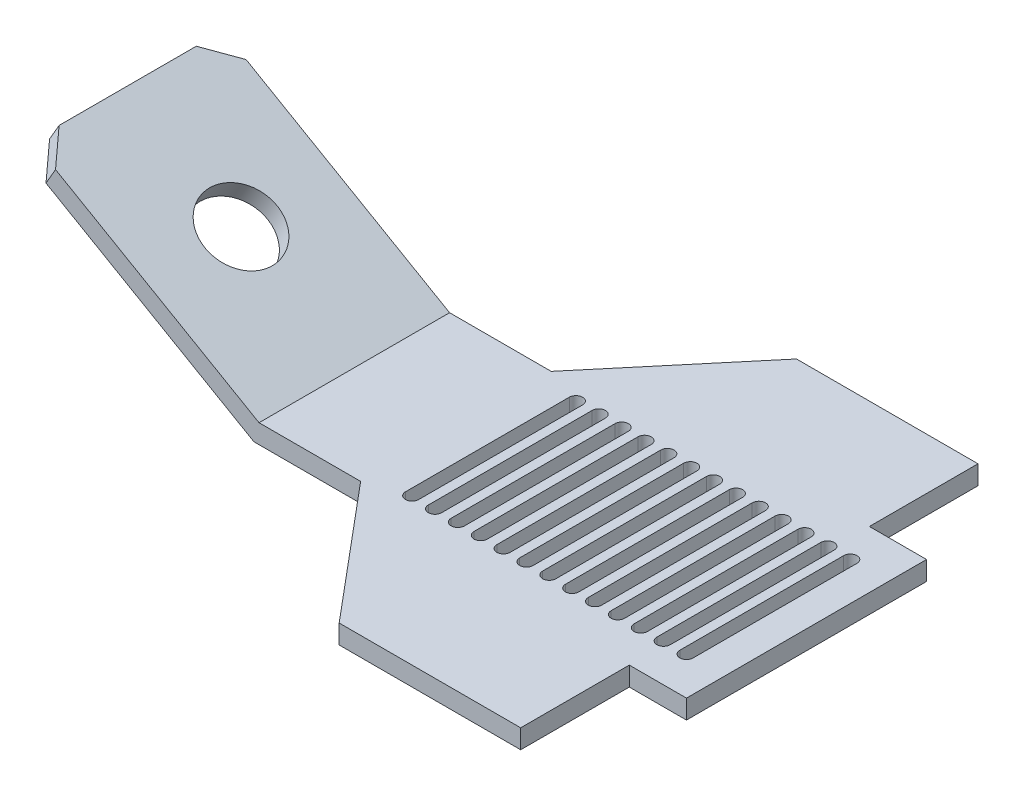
from build123d import *

# Parameters (mm, degrees)
BOSS_EXTRUDE1_DEPTH             = 5
BOSS_EXTRUDE2_REACH             = 136.257
BOSS_EXTRUDE2_DIRECTION_2_REACH = 136.257
CUT_EXTRUDE1_DEPTH              = 194.397994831
LPATTERN1_COUNT                 = 13
LPATTERN1_PITCH                 = 6
CUT_EXTRUDE2_REACH              = 188.034
SKETCH5_R                       = 9.5
CHAMFER1_SIZE                   = 7


with BuildPart() as part:
    # Sketch2 → Boss-Extrude1 (new body)
    with BuildSketch(Plane(origin=(0, 0, 0), x_dir=(1, 0, 0), z_dir=(0, 1, 0))):
        Polygon((0, -31.500950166), (0, 31.500950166), (-15, 31.500950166), (-15, 60), (-62.631512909, 60), (-92, 25), (-120, 25), (-120, -25), (-92, -25), (-62.631512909, -60), (-15, -60), (-15, -31.500950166), align=None)
    extrude(amount=BOSS_EXTRUDE1_DEPTH)

    # Boss-Extrude2: up to this face of the body (flat: up to its plane)
    boss_extrude2_end = Plane(part.part.faces().sort_by_distance((-106, 2.5, 25))[0])
    # Sketch3 → Boss-Extrude2 (add, up to the picked face)
    with BuildSketch(Plane.XY, mode=Mode.PRIVATE) as boss_extrude2_sk1:
        Polygon((-120, 0), (-180.621778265, 35), (-178.121778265, 39.330127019), (-117.5, 4.330127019), align=None)
    boss_extrude2_tool1 = split(extrude(boss_extrude2_sk1.sketch, amount=BOSS_EXTRUDE2_REACH, mode=Mode.PRIVATE), bisect_by=boss_extrude2_end, keep=Keep.BOTH, mode=Mode.PRIVATE)
    add(boss_extrude2_tool1.solids().sort_by(Axis((-149.060889, 19.665064, 0), (0, 0, 1)))[0])

    # Boss-Extrude2 direction 2: up to this face of the body (flat: up to its plane)
    boss_extrude2_direction_2_end = Plane(part.part.faces().sort_by_distance((-106, 2.5, -25))[0])
    # Sketch3 → Boss-Extrude2 direction 2 (add, up to the picked face)
    with BuildSketch(Plane.XY, mode=Mode.PRIVATE) as boss_extrude2_direction_2_sk1:
        Polygon((-120, 0), (-180.621778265, 35), (-178.121778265, 39.330127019), (-117.5, 4.330127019), align=None)
    boss_extrude2_direction_2_tool1 = split(extrude(boss_extrude2_direction_2_sk1.sketch, amount=-BOSS_EXTRUDE2_DIRECTION_2_REACH, mode=Mode.PRIVATE), bisect_by=boss_extrude2_direction_2_end, keep=Keep.BOTH, mode=Mode.PRIVATE)
    add(boss_extrude2_direction_2_tool1.solids().sort_by(Axis((-149.060889, 19.665064, 0), (0, 0, -1)))[0])

    # Sketch4 → Cut-Extrude1 (cut, through all)
    with BuildSketch(Plane(origin=(0, 5, 0), x_dir=(1, 0, 0), z_dir=(0, 1, 0))):
        with BuildLine():
            Line((-11.75, -21.500950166), (-11.75, 21.500950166))
            ThreePointArc((-11.75, 21.500950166), (-10, 23.250950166), (-8.25, 21.500950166))
            Line((-8.25, 21.500950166), (-8.25, -21.500950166))
            ThreePointArc((-8.25, -21.500950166), (-10, -23.250950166), (-11.75, -21.500950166))
        make_face()
    cut_extrude1 = extrude(amount=-CUT_EXTRUDE1_DEPTH, mode=Mode.SUBTRACT)

    # LPattern1: Cut-Extrude1 ×13
    with Locations(*[(-i * LPATTERN1_PITCH, 0, 0) for i in range(1, LPATTERN1_COUNT)]):
        add(cut_extrude1, mode=Mode.SUBTRACT)

    # Sketch5 → Cut-Extrude2 (cut, up to next)
    with BuildSketch(Plane(origin=(-27.5, -47.631397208, 0), x_dir=(0, 0, -1), z_dir=(0.4999999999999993, 0.866025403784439, 0)), mode=Mode.PRIVATE) as cut_extrude2_sk1:
        with Locations(Location((0, 139.592921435, 0), (0, 0, 90))):
            Circle(SKETCH5_R)
    cut_extrude2_tool1 = extrude(cut_extrude2_sk1.sketch, amount=-CUT_EXTRUDE2_REACH, mode=Mode.PRIVATE) & part.part
    add(cut_extrude2_tool1.solids().sort_by_distance((-148.391016, 22.165064, 0))[0], mode=Mode.SUBTRACT)

    # Chamfer1
    chamfer1_edges = [part.edges().sort_by_distance(p)[0] for p in [
        (-179.371778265, 37.165063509, -25),
        (-179.371778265, 37.165063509, 25),
    ]]
    chamfer(chamfer1_edges, length=CHAMFER1_SIZE)


solid = part.part
